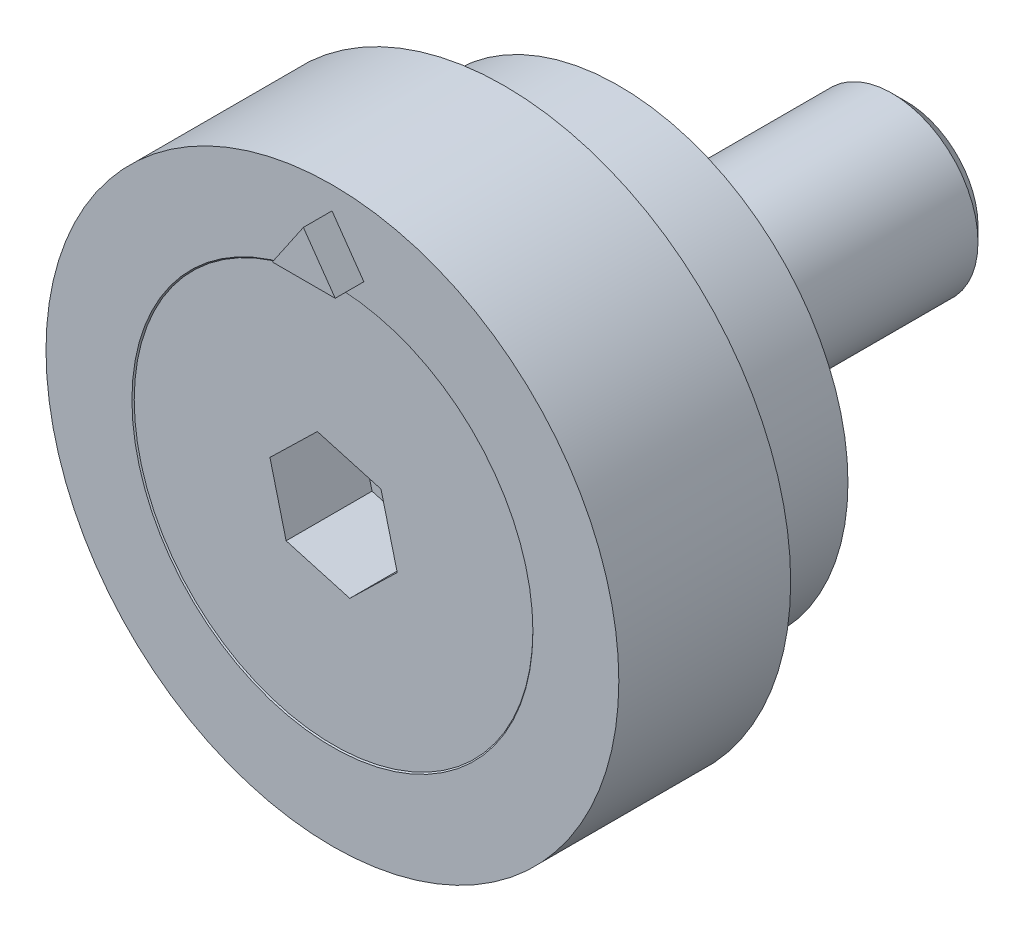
ISO-10303-21;
HEADER;
FILE_DESCRIPTION(('STEP AP214'),'2;1');
FILE_NAME('part.step','',(''),(''),'','','');
FILE_SCHEMA(('AUTOMOTIVE_DESIGN { 1 0 10303 214 1 1 1 1 }'));
ENDSEC;
DATA;
#1=APPLICATION_CONTEXT('core data for automotive mechanical design processes');
#2=APPLICATION_PROTOCOL_DEFINITION('international standard','automotive_design',2000,#1);
#3=PRODUCT_CONTEXT('',#1,'mechanical');
#4=PRODUCT('Part','Part','',(#3));
#5=PRODUCT_RELATED_PRODUCT_CATEGORY('part','',(#4));
#6=PRODUCT_DEFINITION_FORMATION('','',#4);
#7=PRODUCT_DEFINITION_CONTEXT('part definition',#1,'design');
#8=PRODUCT_DEFINITION('design','',#6,#7);
#9=PRODUCT_DEFINITION_SHAPE('','',#8);
#10=(LENGTH_UNIT() NAMED_UNIT(*) SI_UNIT(.MILLI.,.METRE.));
#11=(NAMED_UNIT(*) PLANE_ANGLE_UNIT() SI_UNIT($,.RADIAN.));
#12=(NAMED_UNIT(*) SI_UNIT($,.STERADIAN.) SOLID_ANGLE_UNIT());
#13=UNCERTAINTY_MEASURE_WITH_UNIT(LENGTH_MEASURE(1.E-05),#10,'distance_accuracy_value','');
#14=(GEOMETRIC_REPRESENTATION_CONTEXT(3) GLOBAL_UNCERTAINTY_ASSIGNED_CONTEXT((#13)) GLOBAL_UNIT_ASSIGNED_CONTEXT((#10,
#11,#12)) REPRESENTATION_CONTEXT('',''));
#15=CARTESIAN_POINT('',(0.,0.,0.));
#16=DIRECTION('',(0.,0.,1.));
#17=DIRECTION('',(1.,0.,0.));
#18=AXIS2_PLACEMENT_3D('',#15,#16,#17);
#19=CARTESIAN_POINT('',(0.,0.,-0.0200000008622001));
#20=DIRECTION('',(0.,0.,1.));
#21=DIRECTION('',(1.,0.,0.));
#22=AXIS2_PLACEMENT_3D('',#19,#20,#21);
#23=CYLINDRICAL_SURFACE('',#22,1.5);
#24=CARTESIAN_POINT('',(0.,0.,-2.0000000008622));
#25=DIRECTION('',(0.,0.,1.));
#26=DIRECTION('',(1.,0.,0.));
#27=AXIS2_PLACEMENT_3D('',#24,#25,#26);
#28=CIRCLE('',#27,1.5);
#29=CARTESIAN_POINT('',(1.5,0.,-2.0000000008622));
#30=VERTEX_POINT('',#29);
#31=EDGE_CURVE('P0_E11',#30,#30,#28,.T.);
#32=ORIENTED_EDGE('',*,*,#31,.F.);
#33=EDGE_LOOP('',(#32));
#34=FACE_BOUND('',#33,.T.);
#35=CARTESIAN_POINT('',(0.,0.,-9.7700000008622));
#36=DIRECTION('',(0.,0.,1.));
#37=DIRECTION('',(1.,0.,0.));
#38=AXIS2_PLACEMENT_3D('',#35,#36,#37);
#39=CIRCLE('',#38,1.5);
#40=CARTESIAN_POINT('',(1.5,0.,-9.7700000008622));
#41=VERTEX_POINT('',#40);
#42=EDGE_CURVE('P0_E136',#41,#41,#39,.T.);
#43=ORIENTED_EDGE('',*,*,#42,.T.);
#44=EDGE_LOOP('',(#43));
#45=FACE_BOUND('',#44,.T.);
#46=ADVANCED_FACE('P0_F35',(#34,#45),#23,.T.);
#47=CARTESIAN_POINT('',(0.,0.,-2.0000000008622));
#48=DIRECTION('',(0.,0.,1.));
#49=DIRECTION('',(1.,0.,0.));
#50=AXIS2_PLACEMENT_3D('',#47,#48,#49);
#51=CONICAL_SURFACE('',#50,1.5,0.785398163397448);
#52=CARTESIAN_POINT('',(0.,0.,-0.0200000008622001));
#53=DIRECTION('',(0.,0.,1.));
#54=DIRECTION('',(1.,0.,0.));
#55=AXIS2_PLACEMENT_3D('',#52,#53,#54);
#56=CIRCLE('',#55,3.48);
#57=CARTESIAN_POINT('',(3.48,0.,-0.0200000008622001));
#58=VERTEX_POINT('',#57);
#59=EDGE_CURVE('P0_E42',#58,#58,#56,.T.);
#60=ORIENTED_EDGE('',*,*,#59,.F.);
#61=EDGE_LOOP('',(#60));
#62=FACE_BOUND('',#61,.T.);
#63=ORIENTED_EDGE('',*,*,#31,.T.);
#64=EDGE_LOOP('',(#63));
#65=FACE_BOUND('',#64,.T.);
#66=ADVANCED_FACE('P0_F151',(#62,#65),#51,.T.);
#67=CARTESIAN_POINT('',(0.,3.48,-0.0200000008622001));
#68=DIRECTION('',(0.,0.,-1.));
#69=DIRECTION('',(-1.,0.,0.));
#70=AXIS2_PLACEMENT_3D('',#67,#68,#69);
#71=PLANE('',#70);
#72=DIRECTION('',(0.962144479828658,-0.272539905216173,0.));
#73=VECTOR('',#72,1.);
#74=CARTESIAN_POINT('',(-0.828034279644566,-0.804793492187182,-0.0200000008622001));
#75=LINE('',#74,#73);
#76=CARTESIAN_POINT('',(-0.828034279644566,-0.804793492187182,-0.0200000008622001));
#77=VERTEX_POINT('',#76);
#78=CARTESIAN_POINT('',(0.282954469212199,-1.11949546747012,-0.0200000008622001));
#79=VERTEX_POINT('',#78);
#80=EDGE_CURVE('P0_E123',#77,#79,#75,.T.);
#81=ORIENTED_EDGE('',*,*,#80,.F.);
#82=DIRECTION('',(0.245045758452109,-0.969511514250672,0.));
#83=VECTOR('',#82,1.);
#84=CARTESIAN_POINT('',(-1.11098874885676,0.314701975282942,-0.0200000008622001));
#85=LINE('',#84,#83);
#86=CARTESIAN_POINT('',(-1.11098874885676,0.314701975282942,-0.0200000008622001));
#87=VERTEX_POINT('',#86);
#88=EDGE_CURVE('P0_E49',#87,#77,#85,.T.);
#89=ORIENTED_EDGE('',*,*,#88,.F.);
#90=DIRECTION('',(-0.717098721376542,-0.696971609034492,0.));
#91=VECTOR('',#90,1.);
#92=CARTESIAN_POINT('',(-0.282954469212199,1.11949546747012,-0.0200000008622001));
#93=LINE('',#92,#91);
#94=CARTESIAN_POINT('',(-0.282954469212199,1.11949546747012,-0.0200000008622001));
#95=VERTEX_POINT('',#94);
#96=EDGE_CURVE('P0_E132',#95,#87,#93,.T.);
#97=ORIENTED_EDGE('',*,*,#96,.F.);
#98=DIRECTION('',(-0.962144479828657,0.272539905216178,0.));
#99=VECTOR('',#98,1.);
#100=CARTESIAN_POINT('',(0.828034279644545,0.804793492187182,-0.0200000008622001));
#101=LINE('',#100,#99);
#102=CARTESIAN_POINT('',(0.828034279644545,0.804793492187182,-0.0200000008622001));
#103=VERTEX_POINT('',#102);
#104=EDGE_CURVE('P0_E130',#103,#95,#101,.T.);
#105=ORIENTED_EDGE('',*,*,#104,.F.);
#106=DIRECTION('',(-0.245045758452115,0.96951151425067,0.));
#107=VECTOR('',#106,1.);
#108=CARTESIAN_POINT('',(1.11098874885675,-0.314701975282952,-0.0200000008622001));
#109=LINE('',#108,#107);
#110=CARTESIAN_POINT('',(1.11098874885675,-0.314701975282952,-0.0200000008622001));
#111=VERTEX_POINT('',#110);
#112=EDGE_CURVE('P0_E97',#111,#103,#109,.T.);
#113=ORIENTED_EDGE('',*,*,#112,.F.);
#114=DIRECTION('',(0.717098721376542,0.696971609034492,0.));
#115=VECTOR('',#114,1.);
#116=CARTESIAN_POINT('',(0.282954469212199,-1.11949546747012,-0.0200000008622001));
#117=LINE('',#116,#115);
#118=EDGE_CURVE('P0_E126',#79,#111,#117,.T.);
#119=ORIENTED_EDGE('',*,*,#118,.F.);
#120=EDGE_LOOP('',(#81,#89,#97,#105,#113,#119));
#121=FACE_BOUND('',#120,.T.);
#122=ORIENTED_EDGE('',*,*,#59,.T.);
#123=EDGE_LOOP('',(#122));
#124=FACE_BOUND('',#123,.T.);
#125=ADVANCED_FACE('P0_F149',(#121,#124),#71,.F.);
#126=CARTESIAN_POINT('',(0.,0.,-10.0200000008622));
#127=DIRECTION('',(0.,0.,1.));
#128=DIRECTION('',(1.,0.,0.));
#129=AXIS2_PLACEMENT_3D('',#126,#127,#128);
#130=PLANE('',#129);
#131=CARTESIAN_POINT('',(0.,0.,-10.0200000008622));
#132=DIRECTION('',(0.,0.,1.));
#133=DIRECTION('',(1.,0.,0.));
#134=AXIS2_PLACEMENT_3D('',#131,#132,#133);
#135=CIRCLE('',#134,1.25);
#136=CARTESIAN_POINT('',(1.25,0.,-10.0200000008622));
#137=VERTEX_POINT('',#136);
#138=EDGE_CURVE('P0_E144',#137,#137,#135,.T.);
#139=ORIENTED_EDGE('',*,*,#138,.F.);
#140=EDGE_LOOP('',(#139));
#141=FACE_BOUND('',#140,.T.);
#142=ADVANCED_FACE('P0_F164',(#141),#130,.F.);
#143=CARTESIAN_POINT('',(0.,0.,-10.0200000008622));
#144=DIRECTION('',(0.,0.,1.));
#145=DIRECTION('',(1.,0.,0.));
#146=AXIS2_PLACEMENT_3D('',#143,#144,#145);
#147=CONICAL_SURFACE('',#146,1.25,0.78539816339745);
#148=ORIENTED_EDGE('',*,*,#42,.F.);
#149=EDGE_LOOP('',(#148));
#150=FACE_BOUND('',#149,.T.);
#151=ORIENTED_EDGE('',*,*,#138,.T.);
#152=EDGE_LOOP('',(#151));
#153=FACE_BOUND('',#152,.T.);
#154=ADVANCED_FACE('P0_F160',(#150,#153),#147,.T.);
#155=CARTESIAN_POINT('',(-1.11098874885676,0.314701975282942,-1.5200000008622));
#156=DIRECTION('',(-0.969511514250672,-0.245045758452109,0.));
#157=DIRECTION('',(0.245045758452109,-0.969511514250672,0.));
#158=AXIS2_PLACEMENT_3D('',#155,#156,#157);
#159=PLANE('',#158);
#160=ORIENTED_EDGE('',*,*,#88,.T.);
#161=DIRECTION('',(0.,0.,1.));
#162=VECTOR('',#161,1.);
#163=CARTESIAN_POINT('',(-0.828034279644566,-0.804793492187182,-1.5200000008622));
#164=LINE('',#163,#162);
#165=CARTESIAN_POINT('',(-0.828034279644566,-0.804793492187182,-1.5200000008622));
#166=VERTEX_POINT('',#165);
#167=EDGE_CURVE('P0_E79',#166,#77,#164,.T.);
#168=ORIENTED_EDGE('',*,*,#167,.F.);
#169=DIRECTION('',(0.245045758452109,-0.969511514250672,0.));
#170=VECTOR('',#169,1.);
#171=CARTESIAN_POINT('',(-1.11098874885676,0.314701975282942,-1.5200000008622));
#172=LINE('',#171,#170);
#173=CARTESIAN_POINT('',(-1.11098874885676,0.314701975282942,-1.5200000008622));
#174=VERTEX_POINT('',#173);
#175=EDGE_CURVE('P0_E134',#174,#166,#172,.T.);
#176=ORIENTED_EDGE('',*,*,#175,.F.);
#177=DIRECTION('',(0.,0.,1.));
#178=VECTOR('',#177,1.);
#179=CARTESIAN_POINT('',(-1.11098874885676,0.314701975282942,-1.5200000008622));
#180=LINE('',#179,#178);
#181=EDGE_CURVE('P0_E57',#174,#87,#180,.T.);
#182=ORIENTED_EDGE('',*,*,#181,.T.);
#183=EDGE_LOOP('',(#160,#168,#176,#182));
#184=FACE_BOUND('',#183,.T.);
#185=ADVANCED_FACE('P0_F163',(#184),#159,.F.);
#186=CARTESIAN_POINT('',(-0.282954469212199,1.11949546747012,-1.5200000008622));
#187=DIRECTION('',(-0.696971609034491,0.717098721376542,0.));
#188=DIRECTION('',(-0.717098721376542,-0.696971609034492,0.));
#189=AXIS2_PLACEMENT_3D('',#186,#187,#188);
#190=PLANE('',#189);
#191=ORIENTED_EDGE('',*,*,#96,.T.);
#192=ORIENTED_EDGE('',*,*,#181,.F.);
#193=DIRECTION('',(-0.717098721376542,-0.696971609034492,0.));
#194=VECTOR('',#193,1.);
#195=CARTESIAN_POINT('',(-0.282954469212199,1.11949546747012,-1.5200000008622));
#196=LINE('',#195,#194);
#197=CARTESIAN_POINT('',(-0.282954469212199,1.11949546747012,-1.5200000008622));
#198=VERTEX_POINT('',#197);
#199=EDGE_CURVE('P0_E109',#198,#174,#196,.T.);
#200=ORIENTED_EDGE('',*,*,#199,.F.);
#201=DIRECTION('',(0.,0.,1.));
#202=VECTOR('',#201,1.);
#203=CARTESIAN_POINT('',(-0.282954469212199,1.11949546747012,-1.5200000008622));
#204=LINE('',#203,#202);
#205=EDGE_CURVE('P0_E101',#198,#95,#204,.T.);
#206=ORIENTED_EDGE('',*,*,#205,.T.);
#207=EDGE_LOOP('',(#191,#192,#200,#206));
#208=FACE_BOUND('',#207,.T.);
#209=ADVANCED_FACE('P0_F178',(#208),#190,.F.);
#210=CARTESIAN_POINT('',(0.828034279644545,0.804793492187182,-1.5200000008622));
#211=DIRECTION('',(0.272539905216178,0.962144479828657,0.));
#212=DIRECTION('',(-0.962144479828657,0.272539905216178,0.));
#213=AXIS2_PLACEMENT_3D('',#210,#211,#212);
#214=PLANE('',#213);
#215=ORIENTED_EDGE('',*,*,#104,.T.);
#216=ORIENTED_EDGE('',*,*,#205,.F.);
#217=DIRECTION('',(-0.962144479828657,0.272539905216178,0.));
#218=VECTOR('',#217,1.);
#219=CARTESIAN_POINT('',(0.828034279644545,0.804793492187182,-1.5200000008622));
#220=LINE('',#219,#218);
#221=CARTESIAN_POINT('',(0.828034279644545,0.804793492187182,-1.5200000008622));
#222=VERTEX_POINT('',#221);
#223=EDGE_CURVE('P0_E105',#222,#198,#220,.T.);
#224=ORIENTED_EDGE('',*,*,#223,.F.);
#225=DIRECTION('',(0.,0.,1.));
#226=VECTOR('',#225,1.);
#227=CARTESIAN_POINT('',(0.828034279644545,0.804793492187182,-1.5200000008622));
#228=LINE('',#227,#226);
#229=EDGE_CURVE('P0_E90',#222,#103,#228,.T.);
#230=ORIENTED_EDGE('',*,*,#229,.T.);
#231=EDGE_LOOP('',(#215,#216,#224,#230));
#232=FACE_BOUND('',#231,.T.);
#233=ADVANCED_FACE('P0_F106',(#232),#214,.F.);
#234=CARTESIAN_POINT('',(1.11098874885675,-0.314701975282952,-1.5200000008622));
#235=DIRECTION('',(0.96951151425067,0.245045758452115,0.));
#236=DIRECTION('',(-0.245045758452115,0.96951151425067,0.));
#237=AXIS2_PLACEMENT_3D('',#234,#235,#236);
#238=PLANE('',#237);
#239=ORIENTED_EDGE('',*,*,#112,.T.);
#240=ORIENTED_EDGE('',*,*,#229,.F.);
#241=DIRECTION('',(-0.245045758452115,0.96951151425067,0.));
#242=VECTOR('',#241,1.);
#243=CARTESIAN_POINT('',(1.11098874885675,-0.314701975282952,-1.5200000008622));
#244=LINE('',#243,#242);
#245=CARTESIAN_POINT('',(1.11098874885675,-0.314701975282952,-1.5200000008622));
#246=VERTEX_POINT('',#245);
#247=EDGE_CURVE('P0_E94',#246,#222,#244,.T.);
#248=ORIENTED_EDGE('',*,*,#247,.F.);
#249=DIRECTION('',(0.,0.,1.));
#250=VECTOR('',#249,1.);
#251=CARTESIAN_POINT('',(1.11098874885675,-0.314701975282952,-1.5200000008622));
#252=LINE('',#251,#250);
#253=EDGE_CURVE('P0_E102',#246,#111,#252,.T.);
#254=ORIENTED_EDGE('',*,*,#253,.T.);
#255=EDGE_LOOP('',(#239,#240,#248,#254));
#256=FACE_BOUND('',#255,.T.);
#257=ADVANCED_FACE('P0_F92',(#256),#238,.F.);
#258=CARTESIAN_POINT('',(0.282954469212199,-1.11949546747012,-1.5200000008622));
#259=DIRECTION('',(0.696971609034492,-0.717098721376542,0.));
#260=DIRECTION('',(0.717098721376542,0.696971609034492,0.));
#261=AXIS2_PLACEMENT_3D('',#258,#259,#260);
#262=PLANE('',#261);
#263=ORIENTED_EDGE('',*,*,#118,.T.);
#264=ORIENTED_EDGE('',*,*,#253,.F.);
#265=DIRECTION('',(0.717098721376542,0.696971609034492,0.));
#266=VECTOR('',#265,1.);
#267=CARTESIAN_POINT('',(0.282954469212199,-1.11949546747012,-1.5200000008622));
#268=LINE('',#267,#266);
#269=CARTESIAN_POINT('',(0.282954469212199,-1.11949546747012,-1.5200000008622));
#270=VERTEX_POINT('',#269);
#271=EDGE_CURVE('P0_E115',#270,#246,#268,.T.);
#272=ORIENTED_EDGE('',*,*,#271,.F.);
#273=DIRECTION('',(0.,0.,1.));
#274=VECTOR('',#273,1.);
#275=CARTESIAN_POINT('',(0.282954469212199,-1.11949546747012,-1.5200000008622));
#276=LINE('',#275,#274);
#277=EDGE_CURVE('P0_E139',#270,#79,#276,.T.);
#278=ORIENTED_EDGE('',*,*,#277,.T.);
#279=EDGE_LOOP('',(#263,#264,#272,#278));
#280=FACE_BOUND('',#279,.T.);
#281=ADVANCED_FACE('P0_F182',(#280),#262,.F.);
#282=CARTESIAN_POINT('',(-0.828034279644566,-0.804793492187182,-1.5200000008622));
#283=DIRECTION('',(-0.272539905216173,-0.962144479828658,0.));
#284=DIRECTION('',(0.962144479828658,-0.272539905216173,0.));
#285=AXIS2_PLACEMENT_3D('',#282,#283,#284);
#286=PLANE('',#285);
#287=ORIENTED_EDGE('',*,*,#80,.T.);
#288=ORIENTED_EDGE('',*,*,#277,.F.);
#289=DIRECTION('',(0.962144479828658,-0.272539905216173,0.));
#290=VECTOR('',#289,1.);
#291=CARTESIAN_POINT('',(-0.828034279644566,-0.804793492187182,-1.5200000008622));
#292=LINE('',#291,#290);
#293=EDGE_CURVE('P0_E117',#166,#270,#292,.T.);
#294=ORIENTED_EDGE('',*,*,#293,.F.);
#295=ORIENTED_EDGE('',*,*,#167,.T.);
#296=EDGE_LOOP('',(#287,#288,#294,#295));
#297=FACE_BOUND('',#296,.T.);
#298=ADVANCED_FACE('P0_F179',(#297),#286,.F.);
#299=CARTESIAN_POINT('',(0.,0.,-1.5200000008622));
#300=DIRECTION('',(0.,0.,1.));
#301=DIRECTION('',(1.,0.,0.));
#302=AXIS2_PLACEMENT_3D('',#299,#300,#301);
#303=PLANE('',#302);
#304=ORIENTED_EDGE('',*,*,#175,.T.);
#305=ORIENTED_EDGE('',*,*,#293,.T.);
#306=ORIENTED_EDGE('',*,*,#271,.T.);
#307=ORIENTED_EDGE('',*,*,#247,.T.);
#308=ORIENTED_EDGE('',*,*,#223,.T.);
#309=ORIENTED_EDGE('',*,*,#199,.T.);
#310=EDGE_LOOP('',(#304,#305,#306,#307,#308,#309));
#311=FACE_BOUND('',#310,.T.);
#312=ADVANCED_FACE('P0_F112',(#311),#303,.T.);
#313=CLOSED_SHELL('',(#46,#66,#125,#142,#154,#185,#209,#233,#257,#281,#298,#312));
#314=MANIFOLD_SOLID_BREP('P0_B2',#313);
#315=CARTESIAN_POINT('',(0.,5.,0.));
#316=DIRECTION('',(0.,0.,-1.));
#317=DIRECTION('',(-1.,0.,0.));
#318=AXIS2_PLACEMENT_3D('',#315,#316,#317);
#319=PLANE('',#318);
#320=CARTESIAN_POINT('',(0.,0.,0.));
#321=DIRECTION('',(0.,0.,1.));
#322=DIRECTION('',(1.,0.,0.));
#323=AXIS2_PLACEMENT_3D('',#320,#321,#322);
#324=CIRCLE('',#323,5.);
#325=CARTESIAN_POINT('',(5.,0.,0.));
#326=VERTEX_POINT('',#325);
#327=EDGE_CURVE('P1_E10',#326,#326,#324,.T.);
#328=ORIENTED_EDGE('',*,*,#327,.T.);
#329=EDGE_LOOP('',(#328));
#330=FACE_BOUND('',#329,.T.);
#331=CARTESIAN_POINT('',(0.,0.,0.));
#332=DIRECTION('',(0.,0.,1.));
#333=DIRECTION('',(1.,0.,0.));
#334=AXIS2_PLACEMENT_3D('',#331,#332,#333);
#335=CIRCLE('',#334,3.5000000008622);
#336=CARTESIAN_POINT('',(3.5000000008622,0.,0.));
#337=VERTEX_POINT('',#336);
#338=EDGE_CURVE('P1_E23',#337,#337,#335,.T.);
#339=ORIENTED_EDGE('',*,*,#338,.F.);
#340=EDGE_LOOP('',(#339));
#341=FACE_BOUND('',#340,.T.);
#342=DIRECTION('',(1.,0.,0.));
#343=VECTOR('',#342,1.);
#344=CARTESIAN_POINT('',(-0.548658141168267,3.81,0.));
#345=LINE('',#344,#343);
#346=CARTESIAN_POINT('',(-0.548658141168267,3.81,0.));
#347=VERTEX_POINT('',#346);
#348=CARTESIAN_POINT('',(0.548658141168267,3.81,0.));
#349=VERTEX_POINT('',#348);
#350=EDGE_CURVE('P1_E67',#347,#349,#345,.T.);
#351=ORIENTED_EDGE('',*,*,#350,.F.);
#352=DIRECTION('',(-0.563573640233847,-0.826065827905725,0.));
#353=VECTOR('',#352,1.);
#354=CARTESIAN_POINT('',(-0.00713159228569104,4.60375,0.));
#355=LINE('',#354,#353);
#356=CARTESIAN_POINT('',(-0.00713159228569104,4.60375,0.));
#357=VERTEX_POINT('',#356);
#358=EDGE_CURVE('P1_E34',#357,#347,#355,.T.);
#359=ORIENTED_EDGE('',*,*,#358,.F.);
#360=DIRECTION('',(-0.573576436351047,0.819152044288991,0.));
#361=VECTOR('',#360,1.);
#362=CARTESIAN_POINT('',(0.548658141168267,3.81,0.));
#363=LINE('',#362,#361);
#364=EDGE_CURVE('P1_E30',#349,#357,#363,.T.);
#365=ORIENTED_EDGE('',*,*,#364,.F.);
#366=EDGE_LOOP('',(#351,#359,#365));
#367=FACE_BOUND('',#366,.T.);
#368=ADVANCED_FACE('P1_F15',(#330,#341,#367),#319,.F.);
#369=CARTESIAN_POINT('',(0.,0.,3.12219627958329));
#370=DIRECTION('',(0.,0.,1.));
#371=DIRECTION('',(1.,0.,0.));
#372=AXIS2_PLACEMENT_3D('',#369,#370,#371);
#373=CYLINDRICAL_SURFACE('',#372,5.);
#374=ORIENTED_EDGE('',*,*,#327,.F.);
#375=EDGE_LOOP('',(#374));
#376=FACE_BOUND('',#375,.T.);
#377=CARTESIAN_POINT('',(0.,0.,-3.));
#378=DIRECTION('',(0.,0.,1.));
#379=DIRECTION('',(1.,0.,0.));
#380=AXIS2_PLACEMENT_3D('',#377,#378,#379);
#381=CIRCLE('',#380,5.);
#382=CARTESIAN_POINT('',(5.,0.,-3.));
#383=VERTEX_POINT('',#382);
#384=EDGE_CURVE('P1_E68',#383,#383,#381,.T.);
#385=ORIENTED_EDGE('',*,*,#384,.T.);
#386=EDGE_LOOP('',(#385));
#387=FACE_BOUND('',#386,.T.);
#388=ADVANCED_FACE('P1_F17',(#376,#387),#373,.T.);
#389=CARTESIAN_POINT('',(0.,0.,0.));
#390=DIRECTION('',(0.,0.,1.));
#391=DIRECTION('',(1.,0.,0.));
#392=AXIS2_PLACEMENT_3D('',#389,#390,#391);
#393=CONICAL_SURFACE('',#392,3.5000000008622,0.785398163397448);
#394=CARTESIAN_POINT('',(0.,0.,-2.0000000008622));
#395=DIRECTION('',(0.,0.,1.));
#396=DIRECTION('',(1.,0.,0.));
#397=AXIS2_PLACEMENT_3D('',#394,#395,#396);
#398=CIRCLE('',#397,1.5);
#399=CARTESIAN_POINT('',(1.5,0.,-2.0000000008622));
#400=VERTEX_POINT('',#399);
#401=EDGE_CURVE('P1_E85',#400,#400,#398,.T.);
#402=ORIENTED_EDGE('',*,*,#401,.F.);
#403=EDGE_LOOP('',(#402));
#404=FACE_BOUND('',#403,.T.);
#405=ORIENTED_EDGE('',*,*,#338,.T.);
#406=EDGE_LOOP('',(#405));
#407=FACE_BOUND('',#406,.T.);
#408=ADVANCED_FACE('P1_F90',(#404,#407),#393,.F.);
#409=CARTESIAN_POINT('',(0.,0.,3.12219627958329));
#410=DIRECTION('',(0.,0.,1.));
#411=DIRECTION('',(1.,0.,0.));
#412=AXIS2_PLACEMENT_3D('',#409,#410,#411);
#413=CYLINDRICAL_SURFACE('',#412,1.5);
#414=CARTESIAN_POINT('',(0.,0.,-5.));
#415=DIRECTION('',(0.,0.,1.));
#416=DIRECTION('',(1.,0.,0.));
#417=AXIS2_PLACEMENT_3D('',#414,#415,#416);
#418=CIRCLE('',#417,1.5);
#419=CARTESIAN_POINT('',(1.5,0.,-5.));
#420=VERTEX_POINT('',#419);
#421=EDGE_CURVE('P1_E82',#420,#420,#418,.T.);
#422=ORIENTED_EDGE('',*,*,#421,.F.);
#423=EDGE_LOOP('',(#422));
#424=FACE_BOUND('',#423,.T.);
#425=ORIENTED_EDGE('',*,*,#401,.T.);
#426=EDGE_LOOP('',(#425));
#427=FACE_BOUND('',#426,.T.);
#428=ADVANCED_FACE('P1_F124',(#424,#427),#413,.F.);
#429=CARTESIAN_POINT('',(0.,1.5,-5.));
#430=DIRECTION('',(0.,0.,1.));
#431=DIRECTION('',(1.,0.,0.));
#432=AXIS2_PLACEMENT_3D('',#429,#430,#431);
#433=PLANE('',#432);
#434=CARTESIAN_POINT('',(0.,0.,-5.));
#435=DIRECTION('',(0.,0.,1.));
#436=DIRECTION('',(1.,0.,0.));
#437=AXIS2_PLACEMENT_3D('',#434,#435,#436);
#438=CIRCLE('',#437,4.);
#439=CARTESIAN_POINT('',(4.,0.,-5.));
#440=VERTEX_POINT('',#439);
#441=EDGE_CURVE('P1_E79',#440,#440,#438,.T.);
#442=ORIENTED_EDGE('',*,*,#441,.F.);
#443=EDGE_LOOP('',(#442));
#444=FACE_BOUND('',#443,.T.);
#445=ORIENTED_EDGE('',*,*,#421,.T.);
#446=EDGE_LOOP('',(#445));
#447=FACE_BOUND('',#446,.T.);
#448=ADVANCED_FACE('P1_F120',(#444,#447),#433,.F.);
#449=CARTESIAN_POINT('',(0.,0.,3.12219627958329));
#450=DIRECTION('',(0.,0.,1.));
#451=DIRECTION('',(1.,0.,0.));
#452=AXIS2_PLACEMENT_3D('',#449,#450,#451);
#453=CYLINDRICAL_SURFACE('',#452,4.);
#454=CARTESIAN_POINT('',(0.,0.,-3.));
#455=DIRECTION('',(0.,0.,1.));
#456=DIRECTION('',(1.,0.,0.));
#457=AXIS2_PLACEMENT_3D('',#454,#455,#456);
#458=CIRCLE('',#457,4.);
#459=CARTESIAN_POINT('',(4.,0.,-3.));
#460=VERTEX_POINT('',#459);
#461=EDGE_CURVE('P1_E71',#460,#460,#458,.T.);
#462=ORIENTED_EDGE('',*,*,#461,.F.);
#463=EDGE_LOOP('',(#462));
#464=FACE_BOUND('',#463,.T.);
#465=ORIENTED_EDGE('',*,*,#441,.T.);
#466=EDGE_LOOP('',(#465));
#467=FACE_BOUND('',#466,.T.);
#468=ADVANCED_FACE('P1_F116',(#464,#467),#453,.T.);
#469=CARTESIAN_POINT('',(0.,4.,-3.));
#470=DIRECTION('',(0.,0.,1.));
#471=DIRECTION('',(1.,0.,0.));
#472=AXIS2_PLACEMENT_3D('',#469,#470,#471);
#473=PLANE('',#472);
#474=ORIENTED_EDGE('',*,*,#384,.F.);
#475=EDGE_LOOP('',(#474));
#476=FACE_BOUND('',#475,.T.);
#477=ORIENTED_EDGE('',*,*,#461,.T.);
#478=EDGE_LOOP('',(#477));
#479=FACE_BOUND('',#478,.T.);
#480=ADVANCED_FACE('P1_F113',(#476,#479),#473,.F.);
#481=CARTESIAN_POINT('',(-0.548658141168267,3.81,0.5));
#482=DIRECTION('',(0.,1.,0.));
#483=DIRECTION('',(0.,0.,1.));
#484=AXIS2_PLACEMENT_3D('',#481,#482,#483);
#485=PLANE('',#484);
#486=ORIENTED_EDGE('',*,*,#350,.T.);
#487=DIRECTION('',(0.,0.,-1.));
#488=VECTOR('',#487,1.);
#489=CARTESIAN_POINT('',(0.548658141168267,3.81,0.5));
#490=LINE('',#489,#488);
#491=CARTESIAN_POINT('',(0.548658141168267,3.81,0.5));
#492=VERTEX_POINT('',#491);
#493=EDGE_CURVE('P1_E51',#492,#349,#490,.T.);
#494=ORIENTED_EDGE('',*,*,#493,.F.);
#495=DIRECTION('',(1.,0.,0.));
#496=VECTOR('',#495,1.);
#497=CARTESIAN_POINT('',(-0.548658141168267,3.81,0.5));
#498=LINE('',#497,#496);
#499=CARTESIAN_POINT('',(-0.548658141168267,3.81,0.5));
#500=VERTEX_POINT('',#499);
#501=EDGE_CURVE('P1_E58',#500,#492,#498,.T.);
#502=ORIENTED_EDGE('',*,*,#501,.F.);
#503=DIRECTION('',(0.,0.,-1.));
#504=VECTOR('',#503,1.);
#505=CARTESIAN_POINT('',(-0.548658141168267,3.81,0.5));
#506=LINE('',#505,#504);
#507=EDGE_CURVE('P1_E73',#500,#347,#506,.T.);
#508=ORIENTED_EDGE('',*,*,#507,.T.);
#509=EDGE_LOOP('',(#486,#494,#502,#508));
#510=FACE_BOUND('',#509,.T.);
#511=ADVANCED_FACE('P1_F66',(#510),#485,.F.);
#512=CARTESIAN_POINT('',(0.548658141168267,3.81,0.5));
#513=DIRECTION('',(-0.819152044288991,-0.573576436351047,0.));
#514=DIRECTION('',(0.573576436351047,-0.819152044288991,0.));
#515=AXIS2_PLACEMENT_3D('',#512,#513,#514);
#516=PLANE('',#515);
#517=ORIENTED_EDGE('',*,*,#364,.T.);
#518=DIRECTION('',(0.,0.,-1.));
#519=VECTOR('',#518,1.);
#520=CARTESIAN_POINT('',(-0.00713159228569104,4.60375,0.5));
#521=LINE('',#520,#519);
#522=CARTESIAN_POINT('',(-0.00713159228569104,4.60375,0.5));
#523=VERTEX_POINT('',#522);
#524=EDGE_CURVE('P1_E54',#523,#357,#521,.T.);
#525=ORIENTED_EDGE('',*,*,#524,.F.);
#526=DIRECTION('',(-0.573576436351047,0.819152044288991,0.));
#527=VECTOR('',#526,1.);
#528=CARTESIAN_POINT('',(0.548658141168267,3.81,0.5));
#529=LINE('',#528,#527);
#530=EDGE_CURVE('P1_E47',#492,#523,#529,.T.);
#531=ORIENTED_EDGE('',*,*,#530,.F.);
#532=ORIENTED_EDGE('',*,*,#493,.T.);
#533=EDGE_LOOP('',(#517,#525,#531,#532));
#534=FACE_BOUND('',#533,.T.);
#535=ADVANCED_FACE('P1_F49',(#534),#516,.F.);
#536=CARTESIAN_POINT('',(-0.00713159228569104,4.60375,0.5));
#537=DIRECTION('',(0.826065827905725,-0.563573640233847,0.));
#538=DIRECTION('',(0.563573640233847,0.826065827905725,0.));
#539=AXIS2_PLACEMENT_3D('',#536,#537,#538);
#540=PLANE('',#539);
#541=ORIENTED_EDGE('',*,*,#358,.T.);
#542=ORIENTED_EDGE('',*,*,#507,.F.);
#543=DIRECTION('',(-0.563573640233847,-0.826065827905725,0.));
#544=VECTOR('',#543,1.);
#545=CARTESIAN_POINT('',(-0.00713159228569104,4.60375,0.5));
#546=LINE('',#545,#544);
#547=EDGE_CURVE('P1_E57',#523,#500,#546,.T.);
#548=ORIENTED_EDGE('',*,*,#547,.F.);
#549=ORIENTED_EDGE('',*,*,#524,.T.);
#550=EDGE_LOOP('',(#541,#542,#548,#549));
#551=FACE_BOUND('',#550,.T.);
#552=ADVANCED_FACE('P1_F96',(#551),#540,.F.);
#553=CARTESIAN_POINT('',(-0.548658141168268,3.81,0.5));
#554=DIRECTION('',(0.,0.,-1.));
#555=DIRECTION('',(-1.,0.,0.));
#556=AXIS2_PLACEMENT_3D('',#553,#554,#555);
#557=PLANE('',#556);
#558=ORIENTED_EDGE('',*,*,#501,.T.);
#559=ORIENTED_EDGE('',*,*,#530,.T.);
#560=ORIENTED_EDGE('',*,*,#547,.T.);
#561=EDGE_LOOP('',(#558,#559,#560));
#562=FACE_BOUND('',#561,.T.);
#563=ADVANCED_FACE('P1_F61',(#562),#557,.F.);
#564=CLOSED_SHELL('',(#368,#388,#408,#428,#448,#468,#480,#511,#535,#552,#563));
#565=MANIFOLD_SOLID_BREP('P1_B1',#564);
#566=ADVANCED_BREP_SHAPE_REPRESENTATION('',(#18,#314,#565),#14);
#567=SHAPE_DEFINITION_REPRESENTATION(#9,#566);
ENDSEC;
END-ISO-10303-21;
